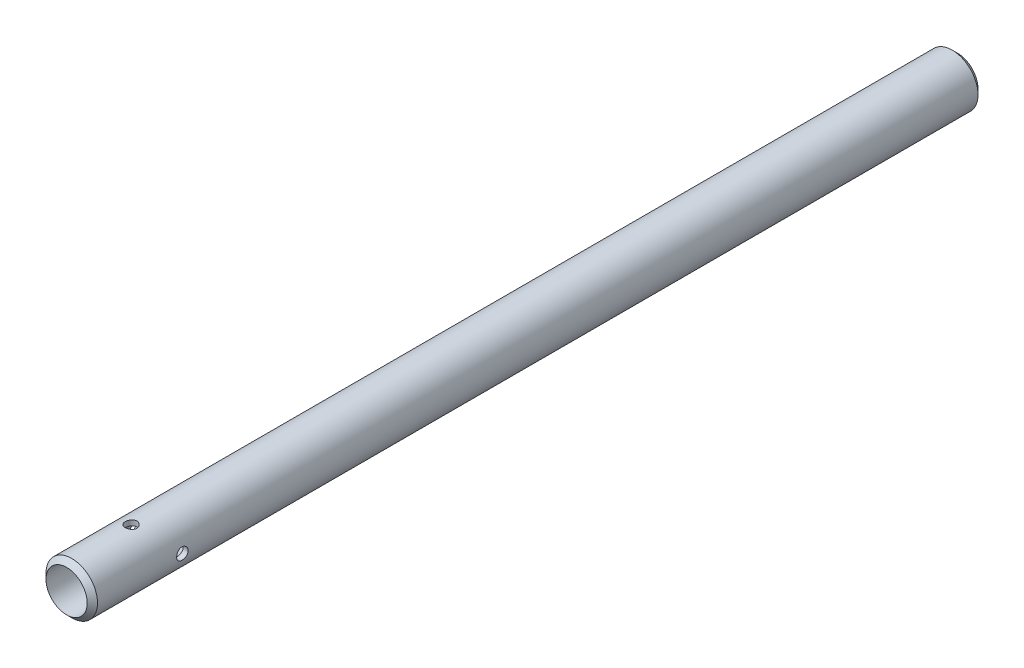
ISO-10303-21;
HEADER;
FILE_DESCRIPTION(('STEP AP214'),'2;1');
FILE_NAME('part.step','',(''),(''),'','','');
FILE_SCHEMA(('AUTOMOTIVE_DESIGN { 1 0 10303 214 1 1 1 1 }'));
ENDSEC;
DATA;
#1=APPLICATION_CONTEXT('core data for automotive mechanical design processes');
#2=APPLICATION_PROTOCOL_DEFINITION('international standard','automotive_design',2000,#1);
#3=PRODUCT_CONTEXT('',#1,'mechanical');
#4=PRODUCT('Part','Part','',(#3));
#5=PRODUCT_RELATED_PRODUCT_CATEGORY('part','',(#4));
#6=PRODUCT_DEFINITION_FORMATION('','',#4);
#7=PRODUCT_DEFINITION_CONTEXT('part definition',#1,'design');
#8=PRODUCT_DEFINITION('design','',#6,#7);
#9=PRODUCT_DEFINITION_SHAPE('','',#8);
#10=(LENGTH_UNIT() NAMED_UNIT(*) SI_UNIT(.MILLI.,.METRE.));
#11=(NAMED_UNIT(*) PLANE_ANGLE_UNIT() SI_UNIT($,.RADIAN.));
#12=(NAMED_UNIT(*) SI_UNIT($,.STERADIAN.) SOLID_ANGLE_UNIT());
#13=UNCERTAINTY_MEASURE_WITH_UNIT(LENGTH_MEASURE(1.E-05),#10,'distance_accuracy_value','');
#14=(GEOMETRIC_REPRESENTATION_CONTEXT(3) GLOBAL_UNCERTAINTY_ASSIGNED_CONTEXT((#13)) GLOBAL_UNIT_ASSIGNED_CONTEXT((#10,
#11,#12)) REPRESENTATION_CONTEXT('',''));
#15=CARTESIAN_POINT('',(0.,0.,0.));
#16=DIRECTION('',(0.,0.,1.));
#17=DIRECTION('',(1.,0.,0.));
#18=AXIS2_PLACEMENT_3D('',#15,#16,#17);
#19=CARTESIAN_POINT('',(0.,0.,173.));
#20=DIRECTION('',(0.,0.,-1.));
#21=DIRECTION('',(-1.,0.,0.));
#22=AXIS2_PLACEMENT_3D('',#19,#20,#21);
#23=CYLINDRICAL_SURFACE('',#22,10.);
#24=CARTESIAN_POINT('',(0.,0.,171.));
#25=DIRECTION('',(0.,0.,1.));
#26=DIRECTION('',(1.,0.,0.));
#27=AXIS2_PLACEMENT_3D('',#24,#25,#26);
#28=CIRCLE('',#27,10.);
#29=CARTESIAN_POINT('',(10.,0.,171.));
#30=VERTEX_POINT('',#29);
#31=EDGE_CURVE('E10',#30,#30,#28,.F.);
#32=ORIENTED_EDGE('',*,*,#31,.T.);
#33=EDGE_LOOP('',(#32));
#34=FACE_BOUND('',#33,.T.);
#35=CARTESIAN_POINT('',(0.,0.,-171.));
#36=DIRECTION('',(0.,0.,1.));
#37=DIRECTION('',(1.,0.,0.));
#38=AXIS2_PLACEMENT_3D('',#35,#36,#37);
#39=CIRCLE('',#38,10.);
#40=CARTESIAN_POINT('',(10.,0.,-171.));
#41=VERTEX_POINT('',#40);
#42=EDGE_CURVE('E33',#41,#41,#39,.T.);
#43=ORIENTED_EDGE('',*,*,#42,.T.);
#44=EDGE_LOOP('',(#43));
#45=FACE_BOUND('',#44,.T.);
#46=CARTESIAN_POINT('',(-10.,0.,140.25));
#47=CARTESIAN_POINT('',(-9.99999771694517,-0.124699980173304,140.249995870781));
#48=CARTESIAN_POINT('',(-9.99764387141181,-0.249449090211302,140.239598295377));
#49=CARTESIAN_POINT('',(-9.9884813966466,-0.495397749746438,140.198329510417));
#50=CARTESIAN_POINT('',(-9.9816697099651,-0.616594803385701,140.167444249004));
#51=CARTESIAN_POINT('',(-9.96434919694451,-0.851849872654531,140.086221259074));
#52=CARTESIAN_POINT('',(-9.95384434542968,-0.965915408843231,140.035904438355));
#53=CARTESIAN_POINT('',(-9.93026839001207,-1.18398243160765,139.917314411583));
#54=CARTESIAN_POINT('',(-9.91719732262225,-1.28798406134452,139.84904146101));
#55=CARTESIAN_POINT('',(-9.88967110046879,-1.48473408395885,139.695255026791));
#56=CARTESIAN_POINT('',(-9.87519795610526,-1.57728781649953,139.609495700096));
#57=CARTESIAN_POINT('',(-9.8466241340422,-1.74682611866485,139.423698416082));
#58=CARTESIAN_POINT('',(-9.83252349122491,-1.82380923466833,139.32365912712));
#59=CARTESIAN_POINT('',(-9.80611312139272,-1.96089062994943,139.110688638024));
#60=CARTESIAN_POINT('',(-9.79382640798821,-2.02077967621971,138.997619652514));
#61=CARTESIAN_POINT('',(-9.77269409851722,-2.1206301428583,138.762699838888));
#62=CARTESIAN_POINT('',(-9.7638480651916,-2.16059409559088,138.640850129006));
#63=CARTESIAN_POINT('',(-9.75078225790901,-2.21881263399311,138.393945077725));
#64=CARTESIAN_POINT('',(-9.74648890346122,-2.23741292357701,138.268975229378));
#65=CARTESIAN_POINT('',(-9.74279372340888,-2.25345144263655,138.017620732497));
#66=CARTESIAN_POINT('',(-9.74339126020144,-2.25089243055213,137.891236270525));
#67=CARTESIAN_POINT('',(-9.7493438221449,-2.2249627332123,137.643224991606));
#68=CARTESIAN_POINT('',(-9.75460659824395,-2.20199557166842,137.521553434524));
#69=CARTESIAN_POINT('',(-9.76915058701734,-2.13654167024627,137.283835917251));
#70=CARTESIAN_POINT('',(-9.77843203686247,-2.0940537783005,137.167790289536));
#71=CARTESIAN_POINT('',(-9.80005729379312,-1.99039912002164,136.943494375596));
#72=CARTESIAN_POINT('',(-9.8124261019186,-1.92907886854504,136.835317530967));
#73=CARTESIAN_POINT('',(-9.83881732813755,-1.78960795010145,136.630640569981));
#74=CARTESIAN_POINT('',(-9.85283998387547,-1.71145486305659,136.534142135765));
#75=CARTESIAN_POINT('',(-9.88135331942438,-1.53840941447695,136.353239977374));
#76=CARTESIAN_POINT('',(-9.89584735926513,-1.44317439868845,136.269164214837));
#77=CARTESIAN_POINT('',(-9.92337817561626,-1.23979023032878,136.118122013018));
#78=CARTESIAN_POINT('',(-9.93641492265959,-1.13164081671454,136.051155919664));
#79=CARTESIAN_POINT('',(-9.95960852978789,-0.905084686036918,135.936145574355));
#80=CARTESIAN_POINT('',(-9.96975853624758,-0.786654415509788,135.888146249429));
#81=CARTESIAN_POINT('',(-9.98598436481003,-0.543129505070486,135.812821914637));
#82=CARTESIAN_POINT('',(-9.99206081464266,-0.418035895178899,135.785493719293));
#83=CARTESIAN_POINT('',(-9.99936485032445,-0.167546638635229,135.752768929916));
#84=CARTESIAN_POINT('',(-10.0006914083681,-0.0422122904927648,135.746924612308));
#85=CARTESIAN_POINT('',(-9.998624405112,0.207642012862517,135.756117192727));
#86=CARTESIAN_POINT('',(-9.99523118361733,0.332162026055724,135.771152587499));
#87=CARTESIAN_POINT('',(-9.98416853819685,0.575355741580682,135.821306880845));
#88=CARTESIAN_POINT('',(-9.97654952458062,0.694080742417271,135.85618914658));
#89=CARTESIAN_POINT('',(-9.95788891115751,0.923993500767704,135.94478290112));
#90=CARTESIAN_POINT('',(-9.94684700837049,1.03518058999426,135.998496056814));
#91=CARTESIAN_POINT('',(-9.92232244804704,1.24869945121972,136.124147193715));
#92=CARTESIAN_POINT('',(-9.9088057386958,1.35087381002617,136.196345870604));
#93=CARTESIAN_POINT('',(-9.8808971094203,1.54181718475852,136.356577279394));
#94=CARTESIAN_POINT('',(-9.86650506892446,1.63058434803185,136.444612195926));
#95=CARTESIAN_POINT('',(-9.83812317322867,1.79397825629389,136.636076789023));
#96=CARTESIAN_POINT('',(-9.82414670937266,1.86829411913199,136.73977413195));
#97=CARTESIAN_POINT('',(-9.79849887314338,1.99845908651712,136.95843968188));
#98=CARTESIAN_POINT('',(-9.78682739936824,2.05430900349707,137.07340739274));
#99=CARTESIAN_POINT('',(-9.76722644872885,2.1455693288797,137.310726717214));
#100=CARTESIAN_POINT('',(-9.75927557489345,2.18109687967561,137.433031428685));
#101=CARTESIAN_POINT('',(-9.7479802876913,2.23104191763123,137.682078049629));
#102=CARTESIAN_POINT('',(-9.74463508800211,2.24546300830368,137.808819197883));
#103=CARTESIAN_POINT('',(-9.74298148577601,2.25262552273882,138.060001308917));
#104=CARTESIAN_POINT('',(-9.74455840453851,2.24586054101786,138.184427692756));
#105=CARTESIAN_POINT('',(-9.75231090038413,2.2119514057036,138.430318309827));
#106=CARTESIAN_POINT('',(-9.75848641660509,2.18480752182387,138.551782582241));
#107=CARTESIAN_POINT('',(-9.77468279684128,2.11115577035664,138.787881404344));
#108=CARTESIAN_POINT('',(-9.78468859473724,2.06472371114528,138.90254070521));
#109=CARTESIAN_POINT('',(-9.80742322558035,1.95387734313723,139.122513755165));
#110=CARTESIAN_POINT('',(-9.82015236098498,1.88946103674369,139.227826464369));
#111=CARTESIAN_POINT('',(-9.8472390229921,1.74285474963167,139.428541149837));
#112=CARTESIAN_POINT('',(-9.86162550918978,1.66031472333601,139.523683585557));
#113=CARTESIAN_POINT('',(-9.89021568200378,1.48050834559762,139.698928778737));
#114=CARTESIAN_POINT('',(-9.90441932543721,1.38323858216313,139.779028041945));
#115=CARTESIAN_POINT('',(-9.9312780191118,1.17510318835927,139.922983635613));
#116=CARTESIAN_POINT('',(-9.94390879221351,1.0640673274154,139.986598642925));
#117=CARTESIAN_POINT('',(-9.96595299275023,0.832614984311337,140.094160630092));
#118=CARTESIAN_POINT('',(-9.97536904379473,0.712206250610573,140.138123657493));
#119=CARTESIAN_POINT('',(-9.98829672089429,0.493113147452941,140.197543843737));
#120=CARTESIAN_POINT('',(-9.99265771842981,0.395589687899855,140.217176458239));
#121=CARTESIAN_POINT('',(-9.99851019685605,0.198721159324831,140.243405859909));
#122=CARTESIAN_POINT('',(-10.000001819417,0.0993761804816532,140.250003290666));
#123=CARTESIAN_POINT('',(-10.,0.,140.25));
#124=B_SPLINE_CURVE_WITH_KNOTS('',3,(#46,#47,#48,#49,#50,#51,#52,#53,#54,#55,#56,#57,#58,#59,
#60,#61,#62,#63,#64,#65,#66,#67,#68,#69,#70,#71,#72,#73,#74,#75,#76,#77,#78,#79,#80,#81,#82,#83,
#84,#85,#86,#87,#88,#89,#90,#91,#92,#93,#94,#95,#96,#97,#98,#99,#100,#101,#102,#103,#104,#105,
#106,#107,#108,#109,#110,#111,#112,#113,#114,#115,#116,#117,#118,#119,#120,#121,#122,#123),
.UNSPECIFIED.,.T.,.F.,(4,2,2,2,2,2,2,2,2,2,2,2,2,2,2,2,2,2,2,2,2,2,2,2,2,2,2,2,2,2,2,2,2,2,2,2,
2,2,4),(0.,0.373736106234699,0.747728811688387,1.12132022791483,1.49490632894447,
1.87416011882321,2.25344929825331,2.63719933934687,3.02090059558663,3.39830126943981,
3.77565274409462,4.14570499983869,4.51577909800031,4.88895317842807,5.262180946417,
5.64396439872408,6.0257555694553,6.40844575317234,6.79107695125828,7.16568740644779,
7.54027089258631,7.91047912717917,8.28072014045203,8.6565015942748,9.03233492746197,
9.41552668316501,9.7987015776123,10.1796449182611,10.5605232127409,10.9325943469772,
11.304660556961,11.6752780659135,12.0459367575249,12.4245075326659,12.8031661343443,
13.1870895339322,13.570698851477,13.86855215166,14.1663907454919),.UNSPECIFIED.);
#125=CARTESIAN_POINT('',(-10.,0.,140.25));
#126=VERTEX_POINT('',#125);
#127=EDGE_CURVE('E76',#126,#126,#124,.T.);
#128=ORIENTED_EDGE('',*,*,#127,.T.);
#129=EDGE_LOOP('',(#128));
#130=FACE_BOUND('',#129,.T.);
#131=CARTESIAN_POINT('',(10.,0.,135.75));
#132=CARTESIAN_POINT('',(9.99999771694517,-0.124699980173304,135.750004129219));
#133=CARTESIAN_POINT('',(9.99764387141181,-0.249449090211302,135.760401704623));
#134=CARTESIAN_POINT('',(9.9884813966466,-0.495397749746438,135.801670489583));
#135=CARTESIAN_POINT('',(9.9816697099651,-0.616594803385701,135.832555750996));
#136=CARTESIAN_POINT('',(9.96434919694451,-0.851849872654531,135.913778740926));
#137=CARTESIAN_POINT('',(9.95384434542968,-0.965915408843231,135.964095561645));
#138=CARTESIAN_POINT('',(9.93026839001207,-1.18398243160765,136.082685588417));
#139=CARTESIAN_POINT('',(9.91719732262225,-1.28798406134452,136.15095853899));
#140=CARTESIAN_POINT('',(9.88967110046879,-1.48473408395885,136.304744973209));
#141=CARTESIAN_POINT('',(9.87519795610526,-1.57728781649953,136.390504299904));
#142=CARTESIAN_POINT('',(9.8466241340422,-1.74682611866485,136.576301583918));
#143=CARTESIAN_POINT('',(9.83252349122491,-1.82380923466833,136.67634087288));
#144=CARTESIAN_POINT('',(9.80611312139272,-1.96089062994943,136.889311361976));
#145=CARTESIAN_POINT('',(9.79382640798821,-2.02077967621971,137.002380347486));
#146=CARTESIAN_POINT('',(9.77269409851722,-2.1206301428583,137.237300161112));
#147=CARTESIAN_POINT('',(9.7638480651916,-2.16059409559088,137.359149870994));
#148=CARTESIAN_POINT('',(9.75078225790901,-2.21881263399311,137.606054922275));
#149=CARTESIAN_POINT('',(9.74648890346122,-2.23741292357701,137.731024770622));
#150=CARTESIAN_POINT('',(9.74279372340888,-2.25345144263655,137.982379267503));
#151=CARTESIAN_POINT('',(9.74339126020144,-2.25089243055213,138.108763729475));
#152=CARTESIAN_POINT('',(9.7493438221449,-2.2249627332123,138.356775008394));
#153=CARTESIAN_POINT('',(9.75460659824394,-2.20199557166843,138.478446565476));
#154=CARTESIAN_POINT('',(9.76915058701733,-2.13654167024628,138.716164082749));
#155=CARTESIAN_POINT('',(9.77843203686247,-2.09405377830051,138.832209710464));
#156=CARTESIAN_POINT('',(9.80005729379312,-1.99039912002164,139.056505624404));
#157=CARTESIAN_POINT('',(9.8124261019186,-1.92907886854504,139.164682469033));
#158=CARTESIAN_POINT('',(9.83881732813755,-1.78960795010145,139.369359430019));
#159=CARTESIAN_POINT('',(9.85283998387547,-1.71145486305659,139.465857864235));
#160=CARTESIAN_POINT('',(9.88135331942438,-1.53840941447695,139.646760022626));
#161=CARTESIAN_POINT('',(9.89584735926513,-1.44317439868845,139.730835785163));
#162=CARTESIAN_POINT('',(9.92337817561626,-1.23979023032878,139.881877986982));
#163=CARTESIAN_POINT('',(9.93641492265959,-1.13164081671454,139.948844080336));
#164=CARTESIAN_POINT('',(9.95960852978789,-0.905084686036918,140.063854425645));
#165=CARTESIAN_POINT('',(9.96975853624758,-0.786654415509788,140.111853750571));
#166=CARTESIAN_POINT('',(9.98598436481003,-0.543129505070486,140.187178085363));
#167=CARTESIAN_POINT('',(9.99206081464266,-0.418035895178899,140.214506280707));
#168=CARTESIAN_POINT('',(9.99936485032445,-0.167546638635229,140.247231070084));
#169=CARTESIAN_POINT('',(10.0006914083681,-0.0422122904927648,140.253075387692));
#170=CARTESIAN_POINT('',(9.998624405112,0.207642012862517,140.243882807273));
#171=CARTESIAN_POINT('',(9.99523118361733,0.332162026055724,140.228847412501));
#172=CARTESIAN_POINT('',(9.98416853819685,0.575355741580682,140.178693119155));
#173=CARTESIAN_POINT('',(9.97654952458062,0.694080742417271,140.14381085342));
#174=CARTESIAN_POINT('',(9.95788891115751,0.923993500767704,140.05521709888));
#175=CARTESIAN_POINT('',(9.94684700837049,1.03518058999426,140.001503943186));
#176=CARTESIAN_POINT('',(9.92232244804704,1.24869945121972,139.875852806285));
#177=CARTESIAN_POINT('',(9.9088057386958,1.35087381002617,139.803654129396));
#178=CARTESIAN_POINT('',(9.8808971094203,1.54181718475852,139.643422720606));
#179=CARTESIAN_POINT('',(9.86650506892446,1.63058434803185,139.555387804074));
#180=CARTESIAN_POINT('',(9.83812317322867,1.79397825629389,139.363923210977));
#181=CARTESIAN_POINT('',(9.82414670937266,1.86829411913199,139.26022586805));
#182=CARTESIAN_POINT('',(9.79849887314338,1.99845908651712,139.04156031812));
#183=CARTESIAN_POINT('',(9.78682739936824,2.05430900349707,138.92659260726));
#184=CARTESIAN_POINT('',(9.76722644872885,2.1455693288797,138.689273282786));
#185=CARTESIAN_POINT('',(9.75927557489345,2.18109687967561,138.566968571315));
#186=CARTESIAN_POINT('',(9.7479802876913,2.23104191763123,138.317921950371));
#187=CARTESIAN_POINT('',(9.74463508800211,2.24546300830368,138.191180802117));
#188=CARTESIAN_POINT('',(9.74298148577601,2.25262552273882,137.939998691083));
#189=CARTESIAN_POINT('',(9.74455840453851,2.24586054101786,137.815572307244));
#190=CARTESIAN_POINT('',(9.75231090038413,2.2119514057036,137.569681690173));
#191=CARTESIAN_POINT('',(9.75848641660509,2.18480752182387,137.448217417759));
#192=CARTESIAN_POINT('',(9.77468279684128,2.11115577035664,137.212118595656));
#193=CARTESIAN_POINT('',(9.78468859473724,2.06472371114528,137.09745929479));
#194=CARTESIAN_POINT('',(9.80742322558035,1.95387734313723,136.877486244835));
#195=CARTESIAN_POINT('',(9.82015236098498,1.88946103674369,136.772173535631));
#196=CARTESIAN_POINT('',(9.8472390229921,1.74285474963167,136.571458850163));
#197=CARTESIAN_POINT('',(9.86162550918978,1.66031472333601,136.476316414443));
#198=CARTESIAN_POINT('',(9.89021568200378,1.48050834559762,136.301071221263));
#199=CARTESIAN_POINT('',(9.90441932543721,1.38323858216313,136.220971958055));
#200=CARTESIAN_POINT('',(9.9312780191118,1.17510318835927,136.077016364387));
#201=CARTESIAN_POINT('',(9.94390879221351,1.0640673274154,136.013401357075));
#202=CARTESIAN_POINT('',(9.96595299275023,0.832614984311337,135.905839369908));
#203=CARTESIAN_POINT('',(9.97536904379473,0.712206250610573,135.861876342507));
#204=CARTESIAN_POINT('',(9.98829672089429,0.493113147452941,135.802456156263));
#205=CARTESIAN_POINT('',(9.99265771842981,0.395589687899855,135.782823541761));
#206=CARTESIAN_POINT('',(9.99851019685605,0.198721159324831,135.756594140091));
#207=CARTESIAN_POINT('',(10.000001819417,0.0993761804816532,135.749996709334));
#208=CARTESIAN_POINT('',(10.,0.,135.75));
#209=B_SPLINE_CURVE_WITH_KNOTS('',3,(#131,#132,#133,#134,#135,#136,#137,#138,#139,#140,#141,
#142,#143,#144,#145,#146,#147,#148,#149,#150,#151,#152,#153,#154,#155,#156,#157,#158,#159,#160,
#161,#162,#163,#164,#165,#166,#167,#168,#169,#170,#171,#172,#173,#174,#175,#176,#177,#178,#179,
#180,#181,#182,#183,#184,#185,#186,#187,#188,#189,#190,#191,#192,#193,#194,#195,#196,#197,#198,
#199,#200,#201,#202,#203,#204,#205,#206,#207,#208),.UNSPECIFIED.,.T.,.F.,(4,2,2,2,2,2,2,2,2,2,2,
2,2,2,2,2,2,2,2,2,2,2,2,2,2,2,2,2,2,2,2,2,2,2,2,2,2,2,4),(0.,0.373736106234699,
0.747728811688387,1.12132022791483,1.49490632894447,1.87416011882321,2.25344929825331,
2.63719933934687,3.02090059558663,3.39830126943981,3.77565274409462,4.1457049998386,
4.51577909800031,4.88895317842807,5.262180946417,5.64396439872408,6.0257555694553,
6.40844575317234,6.79107695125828,7.16568740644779,7.54027089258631,7.91047912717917,
8.28072014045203,8.6565015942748,9.03233492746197,9.41552668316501,9.7987015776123,
10.1796449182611,10.5605232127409,10.9325943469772,11.304660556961,11.6752780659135,
12.0459367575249,12.4245075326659,12.8031661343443,13.1870895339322,13.570698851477,
13.86855215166,14.1663907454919),.UNSPECIFIED.);
#210=CARTESIAN_POINT('',(10.,0.,135.75));
#211=VERTEX_POINT('',#210);
#212=EDGE_CURVE('E50',#211,#211,#209,.T.);
#213=ORIENTED_EDGE('',*,*,#212,.T.);
#214=EDGE_LOOP('',(#213));
#215=FACE_BOUND('',#214,.T.);
#216=CARTESIAN_POINT('',(0.,-10.,150.25));
#217=CARTESIAN_POINT('',(0.124699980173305,-9.99999771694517,150.249995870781));
#218=CARTESIAN_POINT('',(0.249449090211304,-9.99764387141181,150.239598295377));
#219=CARTESIAN_POINT('',(0.495397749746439,-9.9884813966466,150.198329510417));
#220=CARTESIAN_POINT('',(0.616594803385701,-9.9816697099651,150.167444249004));
#221=CARTESIAN_POINT('',(0.851849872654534,-9.96434919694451,150.086221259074));
#222=CARTESIAN_POINT('',(0.965915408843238,-9.95384434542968,150.035904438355));
#223=CARTESIAN_POINT('',(1.18398243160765,-9.93026839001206,149.917314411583));
#224=CARTESIAN_POINT('',(1.28798406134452,-9.91719732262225,149.84904146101));
#225=CARTESIAN_POINT('',(1.48473408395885,-9.88967110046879,149.695255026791));
#226=CARTESIAN_POINT('',(1.57728781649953,-9.87519795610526,149.609495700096));
#227=CARTESIAN_POINT('',(1.74682611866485,-9.8466241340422,149.423698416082));
#228=CARTESIAN_POINT('',(1.82380923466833,-9.83252349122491,149.32365912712));
#229=CARTESIAN_POINT('',(1.96089062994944,-9.80611312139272,149.110688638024));
#230=CARTESIAN_POINT('',(2.02077967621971,-9.79382640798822,148.997619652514));
#231=CARTESIAN_POINT('',(2.1206301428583,-9.77269409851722,148.762699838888));
#232=CARTESIAN_POINT('',(2.16059409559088,-9.7638480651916,148.640850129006));
#233=CARTESIAN_POINT('',(2.21881263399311,-9.75078225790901,148.393945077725));
#234=CARTESIAN_POINT('',(2.23741292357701,-9.74648890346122,148.268975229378));
#235=CARTESIAN_POINT('',(2.25345144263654,-9.74279372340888,148.017620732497));
#236=CARTESIAN_POINT('',(2.25089243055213,-9.74339126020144,147.891236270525));
#237=CARTESIAN_POINT('',(2.22496273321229,-9.7493438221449,147.643224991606));
#238=CARTESIAN_POINT('',(2.20199557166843,-9.75460659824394,147.521553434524));
#239=CARTESIAN_POINT('',(2.13654167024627,-9.76915058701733,147.283835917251));
#240=CARTESIAN_POINT('',(2.0940537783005,-9.77843203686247,147.167790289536));
#241=CARTESIAN_POINT('',(1.99039912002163,-9.80005729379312,146.943494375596));
#242=CARTESIAN_POINT('',(1.92907886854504,-9.8124261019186,146.835317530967));
#243=CARTESIAN_POINT('',(1.78960795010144,-9.83881732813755,146.630640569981));
#244=CARTESIAN_POINT('',(1.71145486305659,-9.85283998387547,146.534142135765));
#245=CARTESIAN_POINT('',(1.53840941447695,-9.88135331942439,146.353239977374));
#246=CARTESIAN_POINT('',(1.44317439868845,-9.89584735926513,146.269164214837));
#247=CARTESIAN_POINT('',(1.23979023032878,-9.92337817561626,146.118122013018));
#248=CARTESIAN_POINT('',(1.13164081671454,-9.93641492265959,146.051155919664));
#249=CARTESIAN_POINT('',(0.905084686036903,-9.9596085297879,145.936145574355));
#250=CARTESIAN_POINT('',(0.786654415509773,-9.96975853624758,145.888146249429));
#251=CARTESIAN_POINT('',(0.54312950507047,-9.98598436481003,145.812821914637));
#252=CARTESIAN_POINT('',(0.418035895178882,-9.99206081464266,145.785493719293));
#253=CARTESIAN_POINT('',(0.167546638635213,-9.99936485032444,145.752768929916));
#254=CARTESIAN_POINT('',(0.0422122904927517,-10.0006914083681,145.746924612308));
#255=CARTESIAN_POINT('',(-0.207642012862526,-9.998624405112,145.756117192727));
#256=CARTESIAN_POINT('',(-0.332162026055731,-9.99523118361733,145.771152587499));
#257=CARTESIAN_POINT('',(-0.575355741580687,-9.98416853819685,145.821306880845));
#258=CARTESIAN_POINT('',(-0.694080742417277,-9.97654952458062,145.85618914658));
#259=CARTESIAN_POINT('',(-0.923993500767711,-9.95788891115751,145.94478290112));
#260=CARTESIAN_POINT('',(-1.03518058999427,-9.94684700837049,145.998496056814));
#261=CARTESIAN_POINT('',(-1.24869945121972,-9.92232244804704,146.124147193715));
#262=CARTESIAN_POINT('',(-1.35087381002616,-9.9088057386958,146.196345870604));
#263=CARTESIAN_POINT('',(-1.54181718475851,-9.8808971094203,146.356577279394));
#264=CARTESIAN_POINT('',(-1.63058434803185,-9.86650506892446,146.444612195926));
#265=CARTESIAN_POINT('',(-1.79397825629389,-9.83812317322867,146.636076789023));
#266=CARTESIAN_POINT('',(-1.86829411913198,-9.82414670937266,146.73977413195));
#267=CARTESIAN_POINT('',(-1.99845908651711,-9.79849887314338,146.95843968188));
#268=CARTESIAN_POINT('',(-2.05430900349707,-9.78682739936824,147.07340739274));
#269=CARTESIAN_POINT('',(-2.14556932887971,-9.76722644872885,147.310726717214));
#270=CARTESIAN_POINT('',(-2.18109687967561,-9.75927557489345,147.433031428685));
#271=CARTESIAN_POINT('',(-2.23104191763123,-9.7479802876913,147.682078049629));
#272=CARTESIAN_POINT('',(-2.24546300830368,-9.74463508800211,147.808819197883));
#273=CARTESIAN_POINT('',(-2.25262552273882,-9.74298148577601,148.060001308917));
#274=CARTESIAN_POINT('',(-2.24586054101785,-9.74455840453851,148.184427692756));
#275=CARTESIAN_POINT('',(-2.2119514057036,-9.75231090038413,148.430318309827));
#276=CARTESIAN_POINT('',(-2.18480752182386,-9.75848641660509,148.551782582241));
#277=CARTESIAN_POINT('',(-2.11115577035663,-9.77468279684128,148.787881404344));
#278=CARTESIAN_POINT('',(-2.06472371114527,-9.78468859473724,148.90254070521));
#279=CARTESIAN_POINT('',(-1.95387734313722,-9.80742322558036,149.122513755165));
#280=CARTESIAN_POINT('',(-1.88946103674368,-9.82015236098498,149.227826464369));
#281=CARTESIAN_POINT('',(-1.74285474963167,-9.8472390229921,149.428541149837));
#282=CARTESIAN_POINT('',(-1.66031472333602,-9.86162550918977,149.523683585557));
#283=CARTESIAN_POINT('',(-1.48050834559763,-9.89021568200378,149.698928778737));
#284=CARTESIAN_POINT('',(-1.38323858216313,-9.90441932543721,149.779028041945));
#285=CARTESIAN_POINT('',(-1.17510318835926,-9.93127801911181,149.922983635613));
#286=CARTESIAN_POINT('',(-1.06406732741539,-9.94390879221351,149.986598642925));
#287=CARTESIAN_POINT('',(-0.832614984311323,-9.96595299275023,150.094160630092));
#288=CARTESIAN_POINT('',(-0.712206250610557,-9.97536904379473,150.138123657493));
#289=CARTESIAN_POINT('',(-0.493113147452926,-9.98829672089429,150.197543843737));
#290=CARTESIAN_POINT('',(-0.395589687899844,-9.99265771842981,150.217176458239));
#291=CARTESIAN_POINT('',(-0.198721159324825,-9.99851019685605,150.243405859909));
#292=CARTESIAN_POINT('',(-0.0993761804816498,-10.000001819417,150.250003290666));
#293=CARTESIAN_POINT('',(0.,-10.,150.25));
#294=B_SPLINE_CURVE_WITH_KNOTS('',3,(#216,#217,#218,#219,#220,#221,#222,#223,#224,#225,#226,
#227,#228,#229,#230,#231,#232,#233,#234,#235,#236,#237,#238,#239,#240,#241,#242,#243,#244,#245,
#246,#247,#248,#249,#250,#251,#252,#253,#254,#255,#256,#257,#258,#259,#260,#261,#262,#263,#264,
#265,#266,#267,#268,#269,#270,#271,#272,#273,#274,#275,#276,#277,#278,#279,#280,#281,#282,#283,
#284,#285,#286,#287,#288,#289,#290,#291,#292,#293),.UNSPECIFIED.,.T.,.F.,(4,2,2,2,2,2,2,2,2,2,2,
2,2,2,2,2,2,2,2,2,2,2,2,2,2,2,2,2,2,2,2,2,2,2,2,2,2,2,4),(0.,0.373736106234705,
0.747728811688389,1.12132022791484,1.49490632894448,1.87416011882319,2.2534492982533,
2.63719933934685,3.02090059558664,3.39830126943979,3.7756527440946,4.14570499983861,
4.51577909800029,4.88895317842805,5.26218094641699,5.64396439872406,6.02575556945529,
6.40844575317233,6.79107695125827,7.16568740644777,7.5402708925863,7.91047912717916,
8.280720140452,8.65650159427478,9.03233492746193,9.41552668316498,9.79870157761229,
10.1796449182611,10.5605232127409,10.9325943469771,11.304660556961,11.6752780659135,
12.0459367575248,12.4245075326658,12.8031661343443,13.1870895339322,13.5706988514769,
13.8685521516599,14.1663907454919),.UNSPECIFIED.);
#295=CARTESIAN_POINT('',(0.,-10.,150.25));
#296=VERTEX_POINT('',#295);
#297=EDGE_CURVE('E87',#296,#296,#294,.T.);
#298=ORIENTED_EDGE('',*,*,#297,.T.);
#299=EDGE_LOOP('',(#298));
#300=FACE_BOUND('',#299,.T.);
#301=CARTESIAN_POINT('',(0.,10.,150.25));
#302=CARTESIAN_POINT('',(-0.124699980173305,9.99999771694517,150.249995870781));
#303=CARTESIAN_POINT('',(-0.249449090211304,9.99764387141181,150.239598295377));
#304=CARTESIAN_POINT('',(-0.495397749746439,9.9884813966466,150.198329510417));
#305=CARTESIAN_POINT('',(-0.616594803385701,9.9816697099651,150.167444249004));
#306=CARTESIAN_POINT('',(-0.851849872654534,9.96434919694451,150.086221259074));
#307=CARTESIAN_POINT('',(-0.965915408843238,9.95384434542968,150.035904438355));
#308=CARTESIAN_POINT('',(-1.18398243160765,9.93026839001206,149.917314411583));
#309=CARTESIAN_POINT('',(-1.28798406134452,9.91719732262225,149.84904146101));
#310=CARTESIAN_POINT('',(-1.48473408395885,9.88967110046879,149.695255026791));
#311=CARTESIAN_POINT('',(-1.57728781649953,9.87519795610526,149.609495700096));
#312=CARTESIAN_POINT('',(-1.74682611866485,9.8466241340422,149.423698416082));
#313=CARTESIAN_POINT('',(-1.82380923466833,9.83252349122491,149.32365912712));
#314=CARTESIAN_POINT('',(-1.96089062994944,9.80611312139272,149.110688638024));
#315=CARTESIAN_POINT('',(-2.02077967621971,9.79382640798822,148.997619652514));
#316=CARTESIAN_POINT('',(-2.1206301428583,9.77269409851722,148.762699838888));
#317=CARTESIAN_POINT('',(-2.16059409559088,9.7638480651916,148.640850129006));
#318=CARTESIAN_POINT('',(-2.21881263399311,9.75078225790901,148.393945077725));
#319=CARTESIAN_POINT('',(-2.23741292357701,9.74648890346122,148.268975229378));
#320=CARTESIAN_POINT('',(-2.25345144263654,9.74279372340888,148.017620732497));
#321=CARTESIAN_POINT('',(-2.25089243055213,9.74339126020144,147.891236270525));
#322=CARTESIAN_POINT('',(-2.22496273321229,9.7493438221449,147.643224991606));
#323=CARTESIAN_POINT('',(-2.20199557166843,9.75460659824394,147.521553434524));
#324=CARTESIAN_POINT('',(-2.13654167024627,9.76915058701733,147.283835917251));
#325=CARTESIAN_POINT('',(-2.0940537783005,9.77843203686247,147.167790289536));
#326=CARTESIAN_POINT('',(-1.99039912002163,9.80005729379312,146.943494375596));
#327=CARTESIAN_POINT('',(-1.92907886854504,9.8124261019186,146.835317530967));
#328=CARTESIAN_POINT('',(-1.78960795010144,9.83881732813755,146.630640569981));
#329=CARTESIAN_POINT('',(-1.71145486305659,9.85283998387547,146.534142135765));
#330=CARTESIAN_POINT('',(-1.53840941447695,9.88135331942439,146.353239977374));
#331=CARTESIAN_POINT('',(-1.44317439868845,9.89584735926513,146.269164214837));
#332=CARTESIAN_POINT('',(-1.23979023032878,9.92337817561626,146.118122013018));
#333=CARTESIAN_POINT('',(-1.13164081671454,9.93641492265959,146.051155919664));
#334=CARTESIAN_POINT('',(-0.905084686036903,9.9596085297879,145.936145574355));
#335=CARTESIAN_POINT('',(-0.786654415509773,9.96975853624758,145.888146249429));
#336=CARTESIAN_POINT('',(-0.54312950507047,9.98598436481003,145.812821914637));
#337=CARTESIAN_POINT('',(-0.418035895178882,9.99206081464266,145.785493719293));
#338=CARTESIAN_POINT('',(-0.167546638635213,9.99936485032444,145.752768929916));
#339=CARTESIAN_POINT('',(-0.0422122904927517,10.0006914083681,145.746924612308));
#340=CARTESIAN_POINT('',(0.207642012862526,9.998624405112,145.756117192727));
#341=CARTESIAN_POINT('',(0.332162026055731,9.99523118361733,145.771152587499));
#342=CARTESIAN_POINT('',(0.575355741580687,9.98416853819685,145.821306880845));
#343=CARTESIAN_POINT('',(0.694080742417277,9.97654952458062,145.85618914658));
#344=CARTESIAN_POINT('',(0.923993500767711,9.95788891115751,145.94478290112));
#345=CARTESIAN_POINT('',(1.03518058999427,9.94684700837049,145.998496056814));
#346=CARTESIAN_POINT('',(1.24869945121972,9.92232244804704,146.124147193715));
#347=CARTESIAN_POINT('',(1.35087381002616,9.9088057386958,146.196345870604));
#348=CARTESIAN_POINT('',(1.54181718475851,9.8808971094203,146.356577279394));
#349=CARTESIAN_POINT('',(1.63058434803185,9.86650506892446,146.444612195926));
#350=CARTESIAN_POINT('',(1.79397825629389,9.83812317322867,146.636076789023));
#351=CARTESIAN_POINT('',(1.86829411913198,9.82414670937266,146.73977413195));
#352=CARTESIAN_POINT('',(1.99845908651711,9.79849887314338,146.95843968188));
#353=CARTESIAN_POINT('',(2.05430900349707,9.78682739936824,147.07340739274));
#354=CARTESIAN_POINT('',(2.14556932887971,9.76722644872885,147.310726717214));
#355=CARTESIAN_POINT('',(2.18109687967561,9.75927557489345,147.433031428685));
#356=CARTESIAN_POINT('',(2.23104191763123,9.7479802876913,147.682078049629));
#357=CARTESIAN_POINT('',(2.24546300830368,9.74463508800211,147.808819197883));
#358=CARTESIAN_POINT('',(2.25262552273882,9.74298148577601,148.060001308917));
#359=CARTESIAN_POINT('',(2.24586054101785,9.74455840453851,148.184427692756));
#360=CARTESIAN_POINT('',(2.2119514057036,9.75231090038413,148.430318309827));
#361=CARTESIAN_POINT('',(2.18480752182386,9.75848641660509,148.551782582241));
#362=CARTESIAN_POINT('',(2.11115577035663,9.77468279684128,148.787881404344));
#363=CARTESIAN_POINT('',(2.06472371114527,9.78468859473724,148.90254070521));
#364=CARTESIAN_POINT('',(1.95387734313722,9.80742322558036,149.122513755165));
#365=CARTESIAN_POINT('',(1.88946103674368,9.82015236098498,149.227826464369));
#366=CARTESIAN_POINT('',(1.74285474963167,9.8472390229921,149.428541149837));
#367=CARTESIAN_POINT('',(1.66031472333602,9.86162550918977,149.523683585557));
#368=CARTESIAN_POINT('',(1.48050834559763,9.89021568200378,149.698928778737));
#369=CARTESIAN_POINT('',(1.38323858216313,9.90441932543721,149.779028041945));
#370=CARTESIAN_POINT('',(1.17510318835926,9.93127801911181,149.922983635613));
#371=CARTESIAN_POINT('',(1.06406732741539,9.94390879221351,149.986598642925));
#372=CARTESIAN_POINT('',(0.832614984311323,9.96595299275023,150.094160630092));
#373=CARTESIAN_POINT('',(0.712206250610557,9.97536904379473,150.138123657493));
#374=CARTESIAN_POINT('',(0.493113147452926,9.98829672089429,150.197543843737));
#375=CARTESIAN_POINT('',(0.395589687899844,9.99265771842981,150.217176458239));
#376=CARTESIAN_POINT('',(0.198721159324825,9.99851019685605,150.243405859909));
#377=CARTESIAN_POINT('',(0.0993761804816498,10.000001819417,150.250003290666));
#378=CARTESIAN_POINT('',(0.,10.,150.25));
#379=B_SPLINE_CURVE_WITH_KNOTS('',3,(#301,#302,#303,#304,#305,#306,#307,#308,#309,#310,#311,
#312,#313,#314,#315,#316,#317,#318,#319,#320,#321,#322,#323,#324,#325,#326,#327,#328,#329,#330,
#331,#332,#333,#334,#335,#336,#337,#338,#339,#340,#341,#342,#343,#344,#345,#346,#347,#348,#349,
#350,#351,#352,#353,#354,#355,#356,#357,#358,#359,#360,#361,#362,#363,#364,#365,#366,#367,#368,
#369,#370,#371,#372,#373,#374,#375,#376,#377,#378),.UNSPECIFIED.,.T.,.F.,(4,2,2,2,2,2,2,2,2,2,2,
2,2,2,2,2,2,2,2,2,2,2,2,2,2,2,2,2,2,2,2,2,2,2,2,2,2,2,4),(0.,0.373736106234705,
0.747728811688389,1.12132022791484,1.49490632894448,1.87416011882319,2.2534492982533,
2.63719933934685,3.02090059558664,3.39830126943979,3.7756527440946,4.14570499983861,
4.51577909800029,4.88895317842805,5.26218094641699,5.64396439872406,6.02575556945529,
6.40844575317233,6.79107695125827,7.16568740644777,7.5402708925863,7.91047912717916,
8.280720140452,8.65650159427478,9.03233492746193,9.41552668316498,9.79870157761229,
10.1796449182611,10.5605232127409,10.9325943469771,11.304660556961,11.6752780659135,
12.0459367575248,12.4245075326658,12.8031661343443,13.1870895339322,13.5706988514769,
13.8685521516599,14.1663907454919),.UNSPECIFIED.);
#380=CARTESIAN_POINT('',(0.,10.,150.25));
#381=VERTEX_POINT('',#380);
#382=EDGE_CURVE('E82',#381,#381,#379,.T.);
#383=ORIENTED_EDGE('',*,*,#382,.T.);
#384=EDGE_LOOP('',(#383));
#385=FACE_BOUND('',#384,.T.);
#386=ADVANCED_FACE('F26',(#34,#45,#130,#215,#300,#385),#23,.T.);
#387=CARTESIAN_POINT('',(0.,0.,173.));
#388=DIRECTION('',(0.,0.,-1.));
#389=DIRECTION('',(-1.,0.,0.));
#390=AXIS2_PLACEMENT_3D('',#387,#388,#389);
#391=CYLINDRICAL_SURFACE('',#390,8.);
#392=CARTESIAN_POINT('',(-8.,0.,140.25));
#393=CARTESIAN_POINT('',(-7.99999842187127,-0.123780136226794,140.249997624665));
#394=CARTESIAN_POINT('',(-7.99709927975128,-0.247584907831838,140.239751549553));
#395=CARTESIAN_POINT('',(-7.98581625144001,-0.491611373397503,140.199120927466));
#396=CARTESIAN_POINT('',(-7.97743015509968,-0.611831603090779,140.168728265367));
#397=CARTESIAN_POINT('',(-7.95609599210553,-0.845132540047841,140.088883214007));
#398=CARTESIAN_POINT('',(-7.94315417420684,-0.958222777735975,140.039456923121));
#399=CARTESIAN_POINT('',(-7.91406663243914,-1.17450981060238,139.923048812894));
#400=CARTESIAN_POINT('',(-7.89792060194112,-1.27770565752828,139.856065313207));
#401=CARTESIAN_POINT('',(-7.86369767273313,-1.47391114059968,139.704638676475));
#402=CARTESIAN_POINT('',(-7.84558491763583,-1.5666320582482,139.619829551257));
#403=CARTESIAN_POINT('',(-7.80969310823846,-1.73674045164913,139.435940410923));
#404=CARTESIAN_POINT('',(-7.79191410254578,-1.81412570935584,139.336858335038));
#405=CARTESIAN_POINT('',(-7.75833082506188,-1.95282069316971,139.12487286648));
#406=CARTESIAN_POINT('',(-7.74257151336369,-2.01378972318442,139.011738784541));
#407=CARTESIAN_POINT('',(-7.71534289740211,-2.11572381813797,138.776309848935));
#408=CARTESIAN_POINT('',(-7.70387270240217,-2.15669303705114,138.654016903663));
#409=CARTESIAN_POINT('',(-7.68689269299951,-2.21644550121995,138.406958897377));
#410=CARTESIAN_POINT('',(-7.68124150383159,-2.2357560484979,138.28233133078));
#411=CARTESIAN_POINT('',(-7.67611771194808,-2.25328816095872,138.031487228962));
#412=CARTESIAN_POINT('',(-7.67664381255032,-2.25151415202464,137.905271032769));
#413=CARTESIAN_POINT('',(-7.6836891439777,-2.22734423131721,137.659019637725));
#414=CARTESIAN_POINT('',(-7.69002021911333,-2.20559571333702,137.538914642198));
#415=CARTESIAN_POINT('',(-7.70765955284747,-2.14313486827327,137.304131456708));
#416=CARTESIAN_POINT('',(-7.71896824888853,-2.10242087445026,137.189453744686));
#417=CARTESIAN_POINT('',(-7.7454475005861,-2.00267907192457,136.967137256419));
#418=CARTESIAN_POINT('',(-7.7606639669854,-1.94343157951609,136.859602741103));
#419=CARTESIAN_POINT('',(-7.7932206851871,-1.80845757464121,136.655779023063));
#420=CARTESIAN_POINT('',(-7.81056139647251,-1.73272749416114,136.559492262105));
#421=CARTESIAN_POINT('',(-7.84618747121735,-1.56366800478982,136.377209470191));
#422=CARTESIAN_POINT('',(-7.86448422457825,-1.46979757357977,136.291716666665));
#423=CARTESIAN_POINT('',(-7.89939668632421,-1.26882591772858,136.137577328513));
#424=CARTESIAN_POINT('',(-7.91601231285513,-1.16172404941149,136.06893161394));
#425=CARTESIAN_POINT('',(-7.94581242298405,-0.936493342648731,135.950178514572));
#426=CARTESIAN_POINT('',(-7.95897833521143,-0.81830929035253,135.900170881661));
#427=CARTESIAN_POINT('',(-7.98026169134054,-0.57475473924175,135.820883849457));
#428=CARTESIAN_POINT('',(-7.9883803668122,-0.449386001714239,135.791599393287));
#429=CARTESIAN_POINT('',(-7.998464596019,-0.199308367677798,135.75540024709));
#430=CARTESIAN_POINT('',(-8.0006180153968,-0.0747057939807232,135.747802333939));
#431=CARTESIAN_POINT('',(-7.99907390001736,0.173996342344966,135.753293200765));
#432=CARTESIAN_POINT('',(-7.9953770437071,0.29809596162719,135.766379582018));
#433=CARTESIAN_POINT('',(-7.98266987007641,0.539771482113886,135.812310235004));
#434=CARTESIAN_POINT('',(-7.97376417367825,0.657427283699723,135.844765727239));
#435=CARTESIAN_POINT('',(-7.95165716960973,0.885607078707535,135.928054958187));
#436=CARTESIAN_POINT('',(-7.93845537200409,0.996130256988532,135.978890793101));
#437=CARTESIAN_POINT('',(-7.90879007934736,1.20950279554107,136.098713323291));
#438=CARTESIAN_POINT('',(-7.89226344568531,1.31214014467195,136.168061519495));
#439=CARTESIAN_POINT('',(-7.85785438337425,1.50455798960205,136.322492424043));
#440=CARTESIAN_POINT('',(-7.83997165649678,1.59433564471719,136.407578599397));
#441=CARTESIAN_POINT('',(-7.80416160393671,1.76142096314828,136.594269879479));
#442=CARTESIAN_POINT('',(-7.78625074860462,1.83824454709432,136.696312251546));
#443=CARTESIAN_POINT('',(-7.75302507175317,1.97369813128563,136.912225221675));
#444=CARTESIAN_POINT('',(-7.73771015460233,2.03232880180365,137.026095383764));
#445=CARTESIAN_POINT('',(-7.71158917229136,2.12929950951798,137.261931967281));
#446=CARTESIAN_POINT('',(-7.70075860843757,2.16775011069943,137.383850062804));
#447=CARTESIAN_POINT('',(-7.68485185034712,2.22349012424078,137.632783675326));
#448=CARTESIAN_POINT('',(-7.67977397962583,2.2407857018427,137.759797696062));
#449=CARTESIAN_POINT('',(-7.67609849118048,2.25334169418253,138.010331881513));
#450=CARTESIAN_POINT('',(-7.67727074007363,2.24938460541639,138.133810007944));
#451=CARTESIAN_POINT('',(-7.68541842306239,2.22138509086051,138.378262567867));
#452=CARTESIAN_POINT('',(-7.69239367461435,2.19734329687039,138.499237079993));
#453=CARTESIAN_POINT('',(-7.71121681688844,2.13033324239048,138.734139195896));
#454=CARTESIAN_POINT('',(-7.72301742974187,2.08754834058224,138.8481231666));
#455=CARTESIAN_POINT('',(-7.75015834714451,1.98440836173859,139.06738423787));
#456=CARTESIAN_POINT('',(-7.76549926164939,1.92405025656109,139.172659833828));
#457=CARTESIAN_POINT('',(-7.79861380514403,1.78517994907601,139.375207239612));
#458=CARTESIAN_POINT('',(-7.81645021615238,1.70614225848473,139.472108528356));
#459=CARTESIAN_POINT('',(-7.85221584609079,1.53313294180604,139.651526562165));
#460=CARTESIAN_POINT('',(-7.87014508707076,1.43915759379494,139.734039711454));
#461=CARTESIAN_POINT('',(-7.90460443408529,1.23615231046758,139.884347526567));
#462=CARTESIAN_POINT('',(-7.92108926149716,1.12680885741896,139.951730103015));
#463=CARTESIAN_POINT('',(-7.95028824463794,0.897882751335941,140.067053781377));
#464=CARTESIAN_POINT('',(-7.96300454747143,0.778305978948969,140.11500595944));
#465=CARTESIAN_POINT('',(-7.98181255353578,0.549510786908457,140.184670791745));
#466=CARTESIAN_POINT('',(-7.98858039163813,0.441170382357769,140.20910846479));
#467=CARTESIAN_POINT('',(-7.99767454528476,0.221893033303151,140.241773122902));
#468=CARTESIAN_POINT('',(-8.00000141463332,0.110956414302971,140.250002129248));
#469=CARTESIAN_POINT('',(-8.,0.,140.25));
#470=B_SPLINE_CURVE_WITH_KNOTS('',3,(#392,#393,#394,#395,#396,#397,#398,#399,#400,#401,#402,
#403,#404,#405,#406,#407,#408,#409,#410,#411,#412,#413,#414,#415,#416,#417,#418,#419,#420,#421,
#422,#423,#424,#425,#426,#427,#428,#429,#430,#431,#432,#433,#434,#435,#436,#437,#438,#439,#440,
#441,#442,#443,#444,#445,#446,#447,#448,#449,#450,#451,#452,#453,#454,#455,#456,#457,#458,#459,
#460,#461,#462,#463,#464,#465,#466,#467,#468,#469),.UNSPECIFIED.,.T.,.F.,(4,2,2,2,2,2,2,2,2,2,2,
2,2,2,2,2,2,2,2,2,2,2,2,2,2,2,2,2,2,2,2,2,2,2,2,2,2,2,4),(0.,0.370933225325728,
0.742015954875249,1.11259166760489,1.48320285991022,1.8623342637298,2.2415204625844,
2.62805703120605,3.01451328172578,3.39134154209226,3.76809070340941,4.13304415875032,
4.49802969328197,4.86751685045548,5.23708407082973,5.62012636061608,6.003187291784,
6.38826990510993,6.77325851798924,7.14597673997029,7.51865174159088,7.8840867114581,
8.24956337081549,8.62277786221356,8.99607466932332,9.38117545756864,9.76626205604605,
10.1492161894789,10.5320586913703,10.900904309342,11.2697383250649,11.6350420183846,
12.000408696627,12.3776301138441,12.7549456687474,13.1415448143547,13.5279232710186,
13.8604689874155,14.1929732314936),.UNSPECIFIED.);
#471=CARTESIAN_POINT('',(-8.,0.,140.25));
#472=VERTEX_POINT('',#471);
#473=EDGE_CURVE('E44',#472,#472,#470,.T.);
#474=ORIENTED_EDGE('',*,*,#473,.F.);
#475=EDGE_LOOP('',(#474));
#476=FACE_BOUND('',#475,.T.);
#477=CARTESIAN_POINT('',(8.,0.,135.75));
#478=CARTESIAN_POINT('',(7.99999842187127,-0.123780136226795,135.750002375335));
#479=CARTESIAN_POINT('',(7.99709927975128,-0.247584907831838,135.760248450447));
#480=CARTESIAN_POINT('',(7.98581625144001,-0.491611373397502,135.800879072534));
#481=CARTESIAN_POINT('',(7.97743015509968,-0.611831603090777,135.831271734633));
#482=CARTESIAN_POINT('',(7.95609599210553,-0.845132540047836,135.911116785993));
#483=CARTESIAN_POINT('',(7.94315417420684,-0.95822277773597,135.960543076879));
#484=CARTESIAN_POINT('',(7.91406663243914,-1.17450981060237,136.076951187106));
#485=CARTESIAN_POINT('',(7.89792060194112,-1.27770565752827,136.143934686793));
#486=CARTESIAN_POINT('',(7.86369767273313,-1.47391114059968,136.295361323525));
#487=CARTESIAN_POINT('',(7.84558491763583,-1.5666320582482,136.380170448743));
#488=CARTESIAN_POINT('',(7.80969310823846,-1.73674045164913,136.564059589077));
#489=CARTESIAN_POINT('',(7.79191410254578,-1.81412570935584,136.663141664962));
#490=CARTESIAN_POINT('',(7.75833082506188,-1.95282069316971,136.87512713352));
#491=CARTESIAN_POINT('',(7.74257151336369,-2.01378972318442,136.988261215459));
#492=CARTESIAN_POINT('',(7.71534289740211,-2.11572381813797,137.223690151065));
#493=CARTESIAN_POINT('',(7.70387270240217,-2.15669303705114,137.345983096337));
#494=CARTESIAN_POINT('',(7.68689269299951,-2.21644550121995,137.593041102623));
#495=CARTESIAN_POINT('',(7.68124150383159,-2.2357560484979,137.71766866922));
#496=CARTESIAN_POINT('',(7.67611771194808,-2.25328816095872,137.968512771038));
#497=CARTESIAN_POINT('',(7.67664381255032,-2.25151415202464,138.094728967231));
#498=CARTESIAN_POINT('',(7.6836891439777,-2.22734423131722,138.340980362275));
#499=CARTESIAN_POINT('',(7.69002021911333,-2.20559571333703,138.461085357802));
#500=CARTESIAN_POINT('',(7.70765955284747,-2.14313486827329,138.695868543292));
#501=CARTESIAN_POINT('',(7.71896824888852,-2.10242087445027,138.810546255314));
#502=CARTESIAN_POINT('',(7.7454475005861,-2.00267907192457,139.032862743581));
#503=CARTESIAN_POINT('',(7.7606639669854,-1.94343157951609,139.140397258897));
#504=CARTESIAN_POINT('',(7.7932206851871,-1.80845757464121,139.344220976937));
#505=CARTESIAN_POINT('',(7.81056139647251,-1.73272749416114,139.440507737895));
#506=CARTESIAN_POINT('',(7.84618747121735,-1.56366800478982,139.622790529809));
#507=CARTESIAN_POINT('',(7.86448422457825,-1.46979757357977,139.708283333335));
#508=CARTESIAN_POINT('',(7.89939668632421,-1.26882591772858,139.862422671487));
#509=CARTESIAN_POINT('',(7.91601231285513,-1.16172404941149,139.93106838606));
#510=CARTESIAN_POINT('',(7.94581242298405,-0.936493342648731,140.049821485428));
#511=CARTESIAN_POINT('',(7.95897833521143,-0.81830929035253,140.099829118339));
#512=CARTESIAN_POINT('',(7.98026169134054,-0.57475473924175,140.179116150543));
#513=CARTESIAN_POINT('',(7.9883803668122,-0.449386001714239,140.208400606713));
#514=CARTESIAN_POINT('',(7.998464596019,-0.199308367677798,140.24459975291));
#515=CARTESIAN_POINT('',(8.0006180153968,-0.0747057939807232,140.252197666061));
#516=CARTESIAN_POINT('',(7.99907390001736,0.173996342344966,140.246706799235));
#517=CARTESIAN_POINT('',(7.9953770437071,0.29809596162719,140.233620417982));
#518=CARTESIAN_POINT('',(7.98266987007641,0.539771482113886,140.187689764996));
#519=CARTESIAN_POINT('',(7.97376417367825,0.657427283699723,140.155234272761));
#520=CARTESIAN_POINT('',(7.95165716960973,0.885607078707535,140.071945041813));
#521=CARTESIAN_POINT('',(7.93845537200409,0.996130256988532,140.021109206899));
#522=CARTESIAN_POINT('',(7.90879007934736,1.20950279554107,139.901286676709));
#523=CARTESIAN_POINT('',(7.89226344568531,1.31214014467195,139.831938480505));
#524=CARTESIAN_POINT('',(7.85785438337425,1.50455798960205,139.677507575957));
#525=CARTESIAN_POINT('',(7.83997165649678,1.59433564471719,139.592421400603));
#526=CARTESIAN_POINT('',(7.80416160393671,1.76142096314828,139.405730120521));
#527=CARTESIAN_POINT('',(7.78625074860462,1.83824454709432,139.303687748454));
#528=CARTESIAN_POINT('',(7.75302507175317,1.97369813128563,139.087774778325));
#529=CARTESIAN_POINT('',(7.73771015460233,2.03232880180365,138.973904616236));
#530=CARTESIAN_POINT('',(7.71158917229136,2.12929950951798,138.738068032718));
#531=CARTESIAN_POINT('',(7.70075860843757,2.16775011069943,138.616149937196));
#532=CARTESIAN_POINT('',(7.68485185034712,2.22349012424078,138.367216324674));
#533=CARTESIAN_POINT('',(7.67977397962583,2.2407857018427,138.240202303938));
#534=CARTESIAN_POINT('',(7.67609849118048,2.25334169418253,137.989668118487));
#535=CARTESIAN_POINT('',(7.67727074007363,2.24938460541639,137.866189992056));
#536=CARTESIAN_POINT('',(7.68541842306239,2.22138509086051,137.621737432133));
#537=CARTESIAN_POINT('',(7.69239367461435,2.19734329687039,137.500762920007));
#538=CARTESIAN_POINT('',(7.71121681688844,2.13033324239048,137.265860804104));
#539=CARTESIAN_POINT('',(7.72301742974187,2.08754834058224,137.1518768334));
#540=CARTESIAN_POINT('',(7.75015834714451,1.98440836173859,136.93261576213));
#541=CARTESIAN_POINT('',(7.76549926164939,1.92405025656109,136.827340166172));
#542=CARTESIAN_POINT('',(7.79861380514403,1.78517994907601,136.624792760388));
#543=CARTESIAN_POINT('',(7.81645021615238,1.70614225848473,136.527891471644));
#544=CARTESIAN_POINT('',(7.85221584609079,1.53313294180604,136.348473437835));
#545=CARTESIAN_POINT('',(7.87014508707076,1.43915759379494,136.265960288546));
#546=CARTESIAN_POINT('',(7.90460443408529,1.23615231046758,136.115652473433));
#547=CARTESIAN_POINT('',(7.92108926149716,1.12680885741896,136.048269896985));
#548=CARTESIAN_POINT('',(7.95028824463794,0.897882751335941,135.932946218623));
#549=CARTESIAN_POINT('',(7.96300454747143,0.778305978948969,135.88499404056));
#550=CARTESIAN_POINT('',(7.98181255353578,0.549510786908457,135.815329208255));
#551=CARTESIAN_POINT('',(7.98858039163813,0.441170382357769,135.79089153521));
#552=CARTESIAN_POINT('',(7.99767454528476,0.221893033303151,135.758226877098));
#553=CARTESIAN_POINT('',(8.00000141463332,0.110956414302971,135.749997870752));
#554=CARTESIAN_POINT('',(8.,0.,135.75));
#555=B_SPLINE_CURVE_WITH_KNOTS('',3,(#477,#478,#479,#480,#481,#482,#483,#484,#485,#486,#487,
#488,#489,#490,#491,#492,#493,#494,#495,#496,#497,#498,#499,#500,#501,#502,#503,#504,#505,#506,
#507,#508,#509,#510,#511,#512,#513,#514,#515,#516,#517,#518,#519,#520,#521,#522,#523,#524,#525,
#526,#527,#528,#529,#530,#531,#532,#533,#534,#535,#536,#537,#538,#539,#540,#541,#542,#543,#544,
#545,#546,#547,#548,#549,#550,#551,#552,#553,#554),.UNSPECIFIED.,.T.,.F.,(4,2,2,2,2,2,2,2,2,2,2,
2,2,2,2,2,2,2,2,2,2,2,2,2,2,2,2,2,2,2,2,2,2,2,2,2,2,2,4),(0.,0.370933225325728,
0.742015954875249,1.11259166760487,1.48320285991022,1.86233426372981,2.24152046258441,
2.62805703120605,3.01451328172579,3.39134154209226,3.76809070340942,4.13304415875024,
4.49802969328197,4.86751685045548,5.23708407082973,5.62012636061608,6.00318729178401,
6.38826990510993,6.77325851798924,7.14597673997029,7.51865174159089,7.8840867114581,
8.2495633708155,8.62277786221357,8.99607466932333,9.38117545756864,9.76626205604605,
10.1492161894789,10.5320586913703,10.900904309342,11.2697383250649,11.6350420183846,
12.000408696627,12.3776301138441,12.7549456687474,13.1415448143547,13.5279232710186,
13.8604689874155,14.1929732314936),.UNSPECIFIED.);
#556=CARTESIAN_POINT('',(8.,0.,135.75));
#557=VERTEX_POINT('',#556);
#558=EDGE_CURVE('E51',#557,#557,#555,.T.);
#559=ORIENTED_EDGE('',*,*,#558,.F.);
#560=EDGE_LOOP('',(#559));
#561=FACE_BOUND('',#560,.T.);
#562=CARTESIAN_POINT('',(0.,-8.,150.25));
#563=CARTESIAN_POINT('',(0.123780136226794,-7.99999842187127,150.249997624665));
#564=CARTESIAN_POINT('',(0.247584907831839,-7.99709927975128,150.239751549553));
#565=CARTESIAN_POINT('',(0.491611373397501,-7.98581625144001,150.199120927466));
#566=CARTESIAN_POINT('',(0.611831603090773,-7.97743015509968,150.168728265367));
#567=CARTESIAN_POINT('',(0.845132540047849,-7.95609599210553,150.088883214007));
#568=CARTESIAN_POINT('',(0.958222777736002,-7.94315417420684,150.039456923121));
#569=CARTESIAN_POINT('',(1.1745098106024,-7.91406663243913,149.923048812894));
#570=CARTESIAN_POINT('',(1.27770565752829,-7.89792060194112,149.856065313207));
#571=CARTESIAN_POINT('',(1.47391114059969,-7.86369767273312,149.704638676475));
#572=CARTESIAN_POINT('',(1.56663205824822,-7.84558491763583,149.619829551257));
#573=CARTESIAN_POINT('',(1.73674045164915,-7.80969310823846,149.435940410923));
#574=CARTESIAN_POINT('',(1.81412570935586,-7.79191410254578,149.336858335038));
#575=CARTESIAN_POINT('',(1.95282069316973,-7.75833082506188,149.12487286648));
#576=CARTESIAN_POINT('',(2.01378972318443,-7.74257151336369,149.01173878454));
#577=CARTESIAN_POINT('',(2.11572381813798,-7.7153428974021,148.776309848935));
#578=CARTESIAN_POINT('',(2.15669303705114,-7.70387270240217,148.654016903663));
#579=CARTESIAN_POINT('',(2.21644550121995,-7.68689269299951,148.406958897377));
#580=CARTESIAN_POINT('',(2.2357560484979,-7.68124150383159,148.28233133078));
#581=CARTESIAN_POINT('',(2.25328816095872,-7.67611771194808,148.031487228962));
#582=CARTESIAN_POINT('',(2.25151415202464,-7.67664381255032,147.905271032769));
#583=CARTESIAN_POINT('',(2.2273442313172,-7.6836891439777,147.659019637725));
#584=CARTESIAN_POINT('',(2.20559571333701,-7.69002021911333,147.538914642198));
#585=CARTESIAN_POINT('',(2.14313486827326,-7.70765955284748,147.304131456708));
#586=CARTESIAN_POINT('',(2.10242087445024,-7.71896824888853,147.189453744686));
#587=CARTESIAN_POINT('',(2.00267907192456,-7.7454475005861,146.967137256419));
#588=CARTESIAN_POINT('',(1.94343157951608,-7.7606639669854,146.859602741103));
#589=CARTESIAN_POINT('',(1.8084575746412,-7.7932206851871,146.655779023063));
#590=CARTESIAN_POINT('',(1.73272749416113,-7.81056139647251,146.559492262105));
#591=CARTESIAN_POINT('',(1.56366800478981,-7.84618747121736,146.377209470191));
#592=CARTESIAN_POINT('',(1.46979757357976,-7.86448422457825,146.291716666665));
#593=CARTESIAN_POINT('',(1.26882591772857,-7.89939668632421,146.137577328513));
#594=CARTESIAN_POINT('',(1.16172404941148,-7.91601231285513,146.06893161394));
#595=CARTESIAN_POINT('',(0.936493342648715,-7.94581242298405,145.950178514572));
#596=CARTESIAN_POINT('',(0.818309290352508,-7.95897833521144,145.900170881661));
#597=CARTESIAN_POINT('',(0.574754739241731,-7.98026169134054,145.820883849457));
#598=CARTESIAN_POINT('',(0.449386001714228,-7.9883803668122,145.791599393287));
#599=CARTESIAN_POINT('',(0.199308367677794,-7.99846459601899,145.75540024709));
#600=CARTESIAN_POINT('',(0.0747057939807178,-8.0006180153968,145.747802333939));
#601=CARTESIAN_POINT('',(-0.17399634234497,-7.99907390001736,145.753293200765));
#602=CARTESIAN_POINT('',(-0.298095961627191,-7.9953770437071,145.766379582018));
#603=CARTESIAN_POINT('',(-0.53977148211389,-7.98266987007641,145.812310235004));
#604=CARTESIAN_POINT('',(-0.657427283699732,-7.97376417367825,145.844765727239));
#605=CARTESIAN_POINT('',(-0.885607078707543,-7.95165716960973,145.928054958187));
#606=CARTESIAN_POINT('',(-0.996130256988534,-7.93845537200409,145.978890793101));
#607=CARTESIAN_POINT('',(-1.20950279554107,-7.90879007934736,146.098713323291));
#608=CARTESIAN_POINT('',(-1.31214014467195,-7.89226344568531,146.168061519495));
#609=CARTESIAN_POINT('',(-1.50455798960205,-7.85785438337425,146.322492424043));
#610=CARTESIAN_POINT('',(-1.59433564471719,-7.83997165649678,146.407578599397));
#611=CARTESIAN_POINT('',(-1.76142096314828,-7.80416160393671,146.594269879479));
#612=CARTESIAN_POINT('',(-1.83824454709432,-7.78625074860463,146.696312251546));
#613=CARTESIAN_POINT('',(-1.97369813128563,-7.75302507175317,146.912225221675));
#614=CARTESIAN_POINT('',(-2.03232880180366,-7.73771015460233,147.026095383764));
#615=CARTESIAN_POINT('',(-2.12929950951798,-7.71158917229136,147.261931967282));
#616=CARTESIAN_POINT('',(-2.16775011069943,-7.70075860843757,147.383850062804));
#617=CARTESIAN_POINT('',(-2.22349012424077,-7.68485185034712,147.632783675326));
#618=CARTESIAN_POINT('',(-2.24078570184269,-7.67977397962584,147.759797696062));
#619=CARTESIAN_POINT('',(-2.25334169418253,-7.67609849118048,148.010331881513));
#620=CARTESIAN_POINT('',(-2.24938460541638,-7.67727074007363,148.133810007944));
#621=CARTESIAN_POINT('',(-2.2213850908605,-7.68541842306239,148.378262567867));
#622=CARTESIAN_POINT('',(-2.19734329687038,-7.69239367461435,148.499237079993));
#623=CARTESIAN_POINT('',(-2.13033324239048,-7.71121681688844,148.734139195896));
#624=CARTESIAN_POINT('',(-2.08754834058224,-7.72301742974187,148.8481231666));
#625=CARTESIAN_POINT('',(-1.98440836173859,-7.75015834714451,149.06738423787));
#626=CARTESIAN_POINT('',(-1.92405025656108,-7.76549926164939,149.172659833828));
#627=CARTESIAN_POINT('',(-1.785179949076,-7.79861380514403,149.375207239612));
#628=CARTESIAN_POINT('',(-1.70614225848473,-7.81645021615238,149.472108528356));
#629=CARTESIAN_POINT('',(-1.53313294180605,-7.85221584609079,149.651526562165));
#630=CARTESIAN_POINT('',(-1.43915759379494,-7.87014508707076,149.734039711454));
#631=CARTESIAN_POINT('',(-1.23615231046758,-7.90460443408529,149.884347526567));
#632=CARTESIAN_POINT('',(-1.12680885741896,-7.92108926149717,149.951730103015));
#633=CARTESIAN_POINT('',(-0.897882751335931,-7.95028824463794,150.067053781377));
#634=CARTESIAN_POINT('',(-0.778305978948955,-7.96300454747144,150.11500595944));
#635=CARTESIAN_POINT('',(-0.54951078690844,-7.98181255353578,150.184670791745));
#636=CARTESIAN_POINT('',(-0.441170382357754,-7.98858039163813,150.20910846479));
#637=CARTESIAN_POINT('',(-0.221893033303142,-7.99767454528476,150.241773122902));
#638=CARTESIAN_POINT('',(-0.110956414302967,-8.00000141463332,150.250002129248));
#639=CARTESIAN_POINT('',(0.,-8.,150.25));
#640=B_SPLINE_CURVE_WITH_KNOTS('',3,(#562,#563,#564,#565,#566,#567,#568,#569,#570,#571,#572,
#573,#574,#575,#576,#577,#578,#579,#580,#581,#582,#583,#584,#585,#586,#587,#588,#589,#590,#591,
#592,#593,#594,#595,#596,#597,#598,#599,#600,#601,#602,#603,#604,#605,#606,#607,#608,#609,#610,
#611,#612,#613,#614,#615,#616,#617,#618,#619,#620,#621,#622,#623,#624,#625,#626,#627,#628,#629,
#630,#631,#632,#633,#634,#635,#636,#637,#638,#639),.UNSPECIFIED.,.T.,.F.,(4,2,2,2,2,2,2,2,2,2,2,
2,2,2,2,2,2,2,2,2,2,2,2,2,2,2,2,2,2,2,2,2,2,2,2,2,2,2,4),(0.,0.370933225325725,
0.742015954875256,1.11259166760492,1.48320285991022,1.86233426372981,2.24152046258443,
2.6280570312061,3.01451328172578,3.39134154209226,3.76809070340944,4.13304415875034,
4.498029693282,4.86751685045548,5.23708407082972,5.62012636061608,6.003187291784,
6.38826990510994,6.77325851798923,7.14597673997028,7.51865174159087,7.88408671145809,
8.24956337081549,8.62277786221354,8.9960746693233,9.38117545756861,9.76626205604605,
10.1492161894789,10.5320586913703,10.900904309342,11.2697383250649,11.6350420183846,
12.0004086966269,12.377630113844,12.7549456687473,13.1415448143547,13.5279232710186,
13.8604689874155,14.1929732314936),.UNSPECIFIED.);
#641=CARTESIAN_POINT('',(0.,-8.,150.25));
#642=VERTEX_POINT('',#641);
#643=EDGE_CURVE('E88',#642,#642,#640,.T.);
#644=ORIENTED_EDGE('',*,*,#643,.F.);
#645=EDGE_LOOP('',(#644));
#646=FACE_BOUND('',#645,.T.);
#647=CARTESIAN_POINT('',(0.,8.,150.25));
#648=CARTESIAN_POINT('',(-0.123780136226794,7.99999842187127,150.249997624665));
#649=CARTESIAN_POINT('',(-0.247584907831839,7.99709927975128,150.239751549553));
#650=CARTESIAN_POINT('',(-0.491611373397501,7.98581625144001,150.199120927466));
#651=CARTESIAN_POINT('',(-0.611831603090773,7.97743015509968,150.168728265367));
#652=CARTESIAN_POINT('',(-0.845132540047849,7.95609599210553,150.088883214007));
#653=CARTESIAN_POINT('',(-0.958222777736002,7.94315417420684,150.039456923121));
#654=CARTESIAN_POINT('',(-1.1745098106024,7.91406663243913,149.923048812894));
#655=CARTESIAN_POINT('',(-1.27770565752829,7.89792060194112,149.856065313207));
#656=CARTESIAN_POINT('',(-1.47391114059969,7.86369767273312,149.704638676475));
#657=CARTESIAN_POINT('',(-1.56663205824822,7.84558491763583,149.619829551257));
#658=CARTESIAN_POINT('',(-1.73674045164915,7.80969310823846,149.435940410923));
#659=CARTESIAN_POINT('',(-1.81412570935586,7.79191410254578,149.336858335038));
#660=CARTESIAN_POINT('',(-1.95282069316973,7.75833082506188,149.12487286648));
#661=CARTESIAN_POINT('',(-2.01378972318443,7.74257151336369,149.01173878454));
#662=CARTESIAN_POINT('',(-2.11572381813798,7.7153428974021,148.776309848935));
#663=CARTESIAN_POINT('',(-2.15669303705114,7.70387270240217,148.654016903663));
#664=CARTESIAN_POINT('',(-2.21644550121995,7.68689269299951,148.406958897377));
#665=CARTESIAN_POINT('',(-2.2357560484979,7.68124150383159,148.28233133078));
#666=CARTESIAN_POINT('',(-2.25328816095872,7.67611771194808,148.031487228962));
#667=CARTESIAN_POINT('',(-2.25151415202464,7.67664381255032,147.905271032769));
#668=CARTESIAN_POINT('',(-2.2273442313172,7.6836891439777,147.659019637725));
#669=CARTESIAN_POINT('',(-2.20559571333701,7.69002021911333,147.538914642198));
#670=CARTESIAN_POINT('',(-2.14313486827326,7.70765955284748,147.304131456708));
#671=CARTESIAN_POINT('',(-2.10242087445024,7.71896824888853,147.189453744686));
#672=CARTESIAN_POINT('',(-2.00267907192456,7.7454475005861,146.967137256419));
#673=CARTESIAN_POINT('',(-1.94343157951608,7.7606639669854,146.859602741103));
#674=CARTESIAN_POINT('',(-1.8084575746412,7.7932206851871,146.655779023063));
#675=CARTESIAN_POINT('',(-1.73272749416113,7.81056139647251,146.559492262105));
#676=CARTESIAN_POINT('',(-1.56366800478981,7.84618747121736,146.377209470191));
#677=CARTESIAN_POINT('',(-1.46979757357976,7.86448422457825,146.291716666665));
#678=CARTESIAN_POINT('',(-1.26882591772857,7.89939668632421,146.137577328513));
#679=CARTESIAN_POINT('',(-1.16172404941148,7.91601231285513,146.06893161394));
#680=CARTESIAN_POINT('',(-0.936493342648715,7.94581242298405,145.950178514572));
#681=CARTESIAN_POINT('',(-0.818309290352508,7.95897833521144,145.900170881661));
#682=CARTESIAN_POINT('',(-0.574754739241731,7.98026169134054,145.820883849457));
#683=CARTESIAN_POINT('',(-0.449386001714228,7.9883803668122,145.791599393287));
#684=CARTESIAN_POINT('',(-0.199308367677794,7.99846459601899,145.75540024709));
#685=CARTESIAN_POINT('',(-0.0747057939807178,8.0006180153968,145.747802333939));
#686=CARTESIAN_POINT('',(0.17399634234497,7.99907390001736,145.753293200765));
#687=CARTESIAN_POINT('',(0.298095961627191,7.9953770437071,145.766379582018));
#688=CARTESIAN_POINT('',(0.53977148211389,7.98266987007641,145.812310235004));
#689=CARTESIAN_POINT('',(0.657427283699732,7.97376417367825,145.844765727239));
#690=CARTESIAN_POINT('',(0.885607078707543,7.95165716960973,145.928054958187));
#691=CARTESIAN_POINT('',(0.996130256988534,7.93845537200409,145.978890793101));
#692=CARTESIAN_POINT('',(1.20950279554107,7.90879007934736,146.098713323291));
#693=CARTESIAN_POINT('',(1.31214014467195,7.89226344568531,146.168061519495));
#694=CARTESIAN_POINT('',(1.50455798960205,7.85785438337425,146.322492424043));
#695=CARTESIAN_POINT('',(1.59433564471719,7.83997165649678,146.407578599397));
#696=CARTESIAN_POINT('',(1.76142096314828,7.80416160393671,146.594269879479));
#697=CARTESIAN_POINT('',(1.83824454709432,7.78625074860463,146.696312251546));
#698=CARTESIAN_POINT('',(1.97369813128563,7.75302507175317,146.912225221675));
#699=CARTESIAN_POINT('',(2.03232880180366,7.73771015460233,147.026095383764));
#700=CARTESIAN_POINT('',(2.12929950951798,7.71158917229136,147.261931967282));
#701=CARTESIAN_POINT('',(2.16775011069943,7.70075860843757,147.383850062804));
#702=CARTESIAN_POINT('',(2.22349012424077,7.68485185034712,147.632783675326));
#703=CARTESIAN_POINT('',(2.24078570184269,7.67977397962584,147.759797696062));
#704=CARTESIAN_POINT('',(2.25334169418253,7.67609849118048,148.010331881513));
#705=CARTESIAN_POINT('',(2.24938460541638,7.67727074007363,148.133810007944));
#706=CARTESIAN_POINT('',(2.2213850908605,7.68541842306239,148.378262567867));
#707=CARTESIAN_POINT('',(2.19734329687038,7.69239367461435,148.499237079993));
#708=CARTESIAN_POINT('',(2.13033324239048,7.71121681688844,148.734139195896));
#709=CARTESIAN_POINT('',(2.08754834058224,7.72301742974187,148.8481231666));
#710=CARTESIAN_POINT('',(1.98440836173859,7.75015834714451,149.06738423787));
#711=CARTESIAN_POINT('',(1.92405025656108,7.76549926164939,149.172659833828));
#712=CARTESIAN_POINT('',(1.785179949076,7.79861380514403,149.375207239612));
#713=CARTESIAN_POINT('',(1.70614225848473,7.81645021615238,149.472108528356));
#714=CARTESIAN_POINT('',(1.53313294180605,7.85221584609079,149.651526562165));
#715=CARTESIAN_POINT('',(1.43915759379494,7.87014508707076,149.734039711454));
#716=CARTESIAN_POINT('',(1.23615231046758,7.90460443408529,149.884347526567));
#717=CARTESIAN_POINT('',(1.12680885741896,7.92108926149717,149.951730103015));
#718=CARTESIAN_POINT('',(0.897882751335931,7.95028824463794,150.067053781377));
#719=CARTESIAN_POINT('',(0.778305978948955,7.96300454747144,150.11500595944));
#720=CARTESIAN_POINT('',(0.54951078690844,7.98181255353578,150.184670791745));
#721=CARTESIAN_POINT('',(0.441170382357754,7.98858039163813,150.20910846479));
#722=CARTESIAN_POINT('',(0.221893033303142,7.99767454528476,150.241773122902));
#723=CARTESIAN_POINT('',(0.110956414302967,8.00000141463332,150.250002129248));
#724=CARTESIAN_POINT('',(0.,8.,150.25));
#725=B_SPLINE_CURVE_WITH_KNOTS('',3,(#647,#648,#649,#650,#651,#652,#653,#654,#655,#656,#657,
#658,#659,#660,#661,#662,#663,#664,#665,#666,#667,#668,#669,#670,#671,#672,#673,#674,#675,#676,
#677,#678,#679,#680,#681,#682,#683,#684,#685,#686,#687,#688,#689,#690,#691,#692,#693,#694,#695,
#696,#697,#698,#699,#700,#701,#702,#703,#704,#705,#706,#707,#708,#709,#710,#711,#712,#713,#714,
#715,#716,#717,#718,#719,#720,#721,#722,#723,#724),.UNSPECIFIED.,.T.,.F.,(4,2,2,2,2,2,2,2,2,2,2,
2,2,2,2,2,2,2,2,2,2,2,2,2,2,2,2,2,2,2,2,2,2,2,2,2,2,2,4),(0.,0.370933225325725,
0.742015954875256,1.11259166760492,1.48320285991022,1.86233426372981,2.24152046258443,
2.6280570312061,3.01451328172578,3.39134154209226,3.76809070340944,4.13304415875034,
4.498029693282,4.86751685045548,5.23708407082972,5.62012636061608,6.003187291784,
6.38826990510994,6.77325851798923,7.14597673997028,7.51865174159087,7.88408671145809,
8.24956337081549,8.62277786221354,8.9960746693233,9.38117545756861,9.76626205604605,
10.1492161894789,10.5320586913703,10.900904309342,11.2697383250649,11.6350420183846,
12.0004086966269,12.377630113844,12.7549456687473,13.1415448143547,13.5279232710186,
13.8604689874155,14.1929732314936),.UNSPECIFIED.);
#726=CARTESIAN_POINT('',(0.,8.,150.25));
#727=VERTEX_POINT('',#726);
#728=EDGE_CURVE('E81',#727,#727,#725,.T.);
#729=ORIENTED_EDGE('',*,*,#728,.F.);
#730=EDGE_LOOP('',(#729));
#731=FACE_BOUND('',#730,.T.);
#732=CARTESIAN_POINT('',(0.,0.,173.));
#733=DIRECTION('',(0.,0.,1.));
#734=DIRECTION('',(1.,0.,0.));
#735=AXIS2_PLACEMENT_3D('',#732,#733,#734);
#736=CIRCLE('',#735,8.);
#737=CARTESIAN_POINT('',(8.,0.,173.));
#738=VERTEX_POINT('',#737);
#739=EDGE_CURVE('E37',#738,#738,#736,.T.);
#740=ORIENTED_EDGE('',*,*,#739,.T.);
#741=EDGE_LOOP('',(#740));
#742=FACE_BOUND('',#741,.T.);
#743=CARTESIAN_POINT('',(0.,0.,-173.));
#744=DIRECTION('',(0.,0.,1.));
#745=DIRECTION('',(1.,0.,0.));
#746=AXIS2_PLACEMENT_3D('',#743,#744,#745);
#747=CIRCLE('',#746,8.);
#748=CARTESIAN_POINT('',(8.,0.,-173.));
#749=VERTEX_POINT('',#748);
#750=EDGE_CURVE('E41',#749,#749,#747,.T.);
#751=ORIENTED_EDGE('',*,*,#750,.F.);
#752=EDGE_LOOP('',(#751));
#753=FACE_BOUND('',#752,.T.);
#754=ADVANCED_FACE('F55',(#476,#561,#646,#731,#742,#753),#391,.F.);
#755=CARTESIAN_POINT('',(0.,-10.,148.));
#756=DIRECTION('',(0.,1.,0.));
#757=DIRECTION('',(0.,0.,1.));
#758=AXIS2_PLACEMENT_3D('',#755,#756,#757);
#759=CYLINDRICAL_SURFACE('',#758,2.25);
#760=ORIENTED_EDGE('',*,*,#728,.T.);
#761=EDGE_LOOP('',(#760));
#762=FACE_BOUND('',#761,.T.);
#763=ORIENTED_EDGE('',*,*,#382,.F.);
#764=EDGE_LOOP('',(#763));
#765=FACE_BOUND('',#764,.T.);
#766=ADVANCED_FACE('F107',(#762,#765),#759,.F.);
#767=ORIENTED_EDGE('',*,*,#643,.T.);
#768=EDGE_LOOP('',(#767));
#769=FACE_BOUND('',#768,.T.);
#770=ORIENTED_EDGE('',*,*,#297,.F.);
#771=EDGE_LOOP('',(#770));
#772=FACE_BOUND('',#771,.T.);
#773=ADVANCED_FACE('F66',(#769,#772),#759,.F.);
#774=CARTESIAN_POINT('',(-10.,0.,138.));
#775=DIRECTION('',(1.,0.,0.));
#776=DIRECTION('',(0.,0.,-1.));
#777=AXIS2_PLACEMENT_3D('',#774,#775,#776);
#778=CYLINDRICAL_SURFACE('',#777,2.25000000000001);
#779=ORIENTED_EDGE('',*,*,#558,.T.);
#780=EDGE_LOOP('',(#779));
#781=FACE_BOUND('',#780,.T.);
#782=ORIENTED_EDGE('',*,*,#212,.F.);
#783=EDGE_LOOP('',(#782));
#784=FACE_BOUND('',#783,.T.);
#785=ADVANCED_FACE('F63',(#781,#784),#778,.F.);
#786=ORIENTED_EDGE('',*,*,#473,.T.);
#787=EDGE_LOOP('',(#786));
#788=FACE_BOUND('',#787,.T.);
#789=ORIENTED_EDGE('',*,*,#127,.F.);
#790=EDGE_LOOP('',(#789));
#791=FACE_BOUND('',#790,.T.);
#792=ADVANCED_FACE('F58',(#788,#791),#778,.F.);
#793=CARTESIAN_POINT('',(0.,0.,173.));
#794=DIRECTION('',(0.,0.,-1.));
#795=DIRECTION('',(-1.,0.,0.));
#796=AXIS2_PLACEMENT_3D('',#793,#794,#795);
#797=CONICAL_SURFACE('',#796,7.99999999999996,0.785398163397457);
#798=ORIENTED_EDGE('',*,*,#31,.F.);
#799=EDGE_LOOP('',(#798));
#800=FACE_BOUND('',#799,.T.);
#801=ORIENTED_EDGE('',*,*,#739,.F.);
#802=EDGE_LOOP('',(#801));
#803=FACE_BOUND('',#802,.T.);
#804=ADVANCED_FACE('F62',(#800,#803),#797,.T.);
#805=CARTESIAN_POINT('',(0.,0.,-171.));
#806=DIRECTION('',(0.,0.,1.));
#807=DIRECTION('',(1.,0.,0.));
#808=AXIS2_PLACEMENT_3D('',#805,#806,#807);
#809=CONICAL_SURFACE('',#808,10.,0.785398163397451);
#810=ORIENTED_EDGE('',*,*,#750,.T.);
#811=EDGE_LOOP('',(#810));
#812=FACE_BOUND('',#811,.T.);
#813=ORIENTED_EDGE('',*,*,#42,.F.);
#814=EDGE_LOOP('',(#813));
#815=FACE_BOUND('',#814,.T.);
#816=ADVANCED_FACE('F115',(#812,#815),#809,.T.);
#817=CLOSED_SHELL('',(#386,#754,#766,#773,#785,#792,#804,#816));
#818=MANIFOLD_SOLID_BREP('B2',#817);
#819=ADVANCED_BREP_SHAPE_REPRESENTATION('',(#18,#818),#14);
#820=SHAPE_DEFINITION_REPRESENTATION(#9,#819);
ENDSEC;
END-ISO-10303-21;
